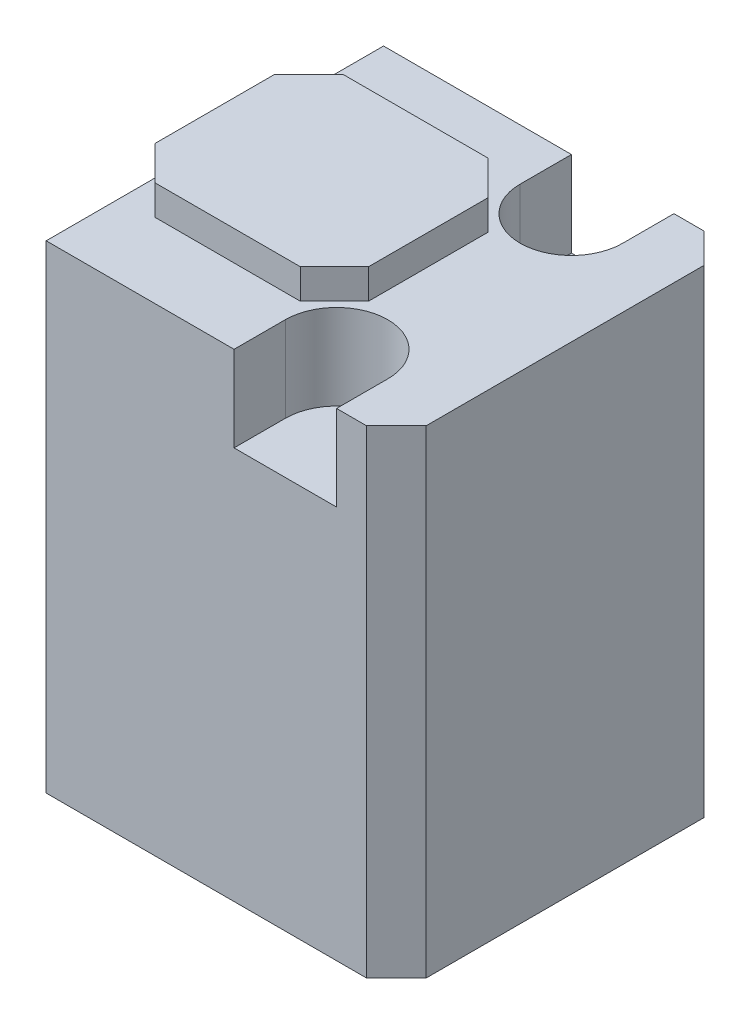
ISO-10303-21;
HEADER;
FILE_DESCRIPTION(('STEP AP214'),'2;1');
FILE_NAME('part.step','',(''),(''),'','','');
FILE_SCHEMA(('AUTOMOTIVE_DESIGN { 1 0 10303 214 1 1 1 1 }'));
ENDSEC;
DATA;
#1=APPLICATION_CONTEXT('core data for automotive mechanical design processes');
#2=APPLICATION_PROTOCOL_DEFINITION('international standard','automotive_design',2000,#1);
#3=PRODUCT_CONTEXT('',#1,'mechanical');
#4=PRODUCT('Part','Part','',(#3));
#5=PRODUCT_RELATED_PRODUCT_CATEGORY('part','',(#4));
#6=PRODUCT_DEFINITION_FORMATION('','',#4);
#7=PRODUCT_DEFINITION_CONTEXT('part definition',#1,'design');
#8=PRODUCT_DEFINITION('design','',#6,#7);
#9=PRODUCT_DEFINITION_SHAPE('','',#8);
#10=(LENGTH_UNIT() NAMED_UNIT(*) SI_UNIT(.MILLI.,.METRE.));
#11=(NAMED_UNIT(*) PLANE_ANGLE_UNIT() SI_UNIT($,.RADIAN.));
#12=(NAMED_UNIT(*) SI_UNIT($,.STERADIAN.) SOLID_ANGLE_UNIT());
#13=UNCERTAINTY_MEASURE_WITH_UNIT(LENGTH_MEASURE(1.E-05),#10,'distance_accuracy_value','');
#14=(GEOMETRIC_REPRESENTATION_CONTEXT(3) GLOBAL_UNCERTAINTY_ASSIGNED_CONTEXT((#13)) GLOBAL_UNIT_ASSIGNED_CONTEXT((#10,
#11,#12)) REPRESENTATION_CONTEXT('',''));
#15=CARTESIAN_POINT('',(0.,0.,0.));
#16=DIRECTION('',(0.,0.,1.));
#17=DIRECTION('',(1.,0.,0.));
#18=AXIS2_PLACEMENT_3D('',#15,#16,#17);
#19=CARTESIAN_POINT('',(0.,14.224,-10.033));
#20=DIRECTION('',(0.,-1.,0.));
#21=DIRECTION('',(0.,0.,-1.));
#22=AXIS2_PLACEMENT_3D('',#19,#20,#21);
#23=PLANE('',#22);
#24=DIRECTION('',(0.707106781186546,0.,0.707106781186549));
#25=VECTOR('',#24,1.);
#26=CARTESIAN_POINT('',(0.,14.224,-3.23850000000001));
#27=LINE('',#26,#25);
#28=CARTESIAN_POINT('',(0.,14.224,-3.23850000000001));
#29=VERTEX_POINT('',#28);
#30=CARTESIAN_POINT('',(1.016,14.224,-2.2225));
#31=VERTEX_POINT('',#30);
#32=EDGE_CURVE('E376',#29,#31,#27,.T.);
#33=ORIENTED_EDGE('',*,*,#32,.F.);
#34=DIRECTION('',(0.,0.,1.));
#35=VECTOR('',#34,1.);
#36=CARTESIAN_POINT('',(0.,14.224,0.));
#37=LINE('',#36,#35);
#38=CARTESIAN_POINT('',(0.,14.224,0.));
#39=VERTEX_POINT('',#38);
#40=EDGE_CURVE('E270',#29,#39,#37,.T.);
#41=ORIENTED_EDGE('',*,*,#40,.T.);
#42=DIRECTION('',(1.,0.,0.));
#43=VECTOR('',#42,1.);
#44=CARTESIAN_POINT('',(0.,14.224,0.));
#45=LINE('',#44,#43);
#46=CARTESIAN_POINT('',(5.588,14.224,0.));
#47=VERTEX_POINT('',#46);
#48=EDGE_CURVE('E273',#39,#47,#45,.T.);
#49=ORIENTED_EDGE('',*,*,#48,.T.);
#50=DIRECTION('',(0.,0.,1.));
#51=VECTOR('',#50,1.);
#52=CARTESIAN_POINT('',(5.588,14.224,0.));
#53=LINE('',#52,#51);
#54=CARTESIAN_POINT('',(5.588,14.224,-1.524));
#55=VERTEX_POINT('',#54);
#56=EDGE_CURVE('E223',#55,#47,#53,.T.);
#57=ORIENTED_EDGE('',*,*,#56,.F.);
#58=CARTESIAN_POINT('',(7.112,14.224,-1.524));
#59=DIRECTION('',(0.,1.,0.));
#60=DIRECTION('',(0.,0.,1.));
#61=AXIS2_PLACEMENT_3D('',#58,#59,#60);
#62=CIRCLE('',#61,1.524);
#63=CARTESIAN_POINT('',(8.636,14.224,-1.524));
#64=VERTEX_POINT('',#63);
#65=EDGE_CURVE('E235',#64,#55,#62,.T.);
#66=ORIENTED_EDGE('',*,*,#65,.F.);
#67=DIRECTION('',(0.,0.,-1.));
#68=VECTOR('',#67,1.);
#69=CARTESIAN_POINT('',(8.636,14.224,0.));
#70=LINE('',#69,#68);
#71=CARTESIAN_POINT('',(8.636,14.224,0.));
#72=VERTEX_POINT('',#71);
#73=EDGE_CURVE('E232',#72,#64,#70,.T.);
#74=ORIENTED_EDGE('',*,*,#73,.F.);
#75=CARTESIAN_POINT('',(9.525,14.224,0.));
#76=VERTEX_POINT('',#75);
#77=EDGE_CURVE('E280',#72,#76,#45,.T.);
#78=ORIENTED_EDGE('',*,*,#77,.T.);
#79=DIRECTION('',(-0.707106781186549,0.,0.707106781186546));
#80=VECTOR('',#79,1.);
#81=CARTESIAN_POINT('',(10.414,14.224,-0.889000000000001));
#82=LINE('',#81,#80);
#83=CARTESIAN_POINT('',(10.414,14.224,-0.889000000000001));
#84=VERTEX_POINT('',#83);
#85=EDGE_CURVE('E283',#76,#84,#82,.F.);
#86=ORIENTED_EDGE('',*,*,#85,.T.);
#87=DIRECTION('',(0.,0.,-1.));
#88=VECTOR('',#87,1.);
#89=CARTESIAN_POINT('',(10.414,14.224,0.));
#90=LINE('',#89,#88);
#91=CARTESIAN_POINT('',(10.414,14.224,-9.144));
#92=VERTEX_POINT('',#91);
#93=EDGE_CURVE('E306',#84,#92,#90,.T.);
#94=ORIENTED_EDGE('',*,*,#93,.T.);
#95=DIRECTION('',(0.707106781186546,0.,0.707106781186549));
#96=VECTOR('',#95,1.);
#97=CARTESIAN_POINT('',(9.525,14.224,-10.033));
#98=LINE('',#97,#96);
#99=CARTESIAN_POINT('',(9.525,14.224,-10.033));
#100=VERTEX_POINT('',#99);
#101=EDGE_CURVE('E35',#92,#100,#98,.F.);
#102=ORIENTED_EDGE('',*,*,#101,.T.);
#103=DIRECTION('',(-1.,0.,0.));
#104=VECTOR('',#103,1.);
#105=CARTESIAN_POINT('',(0.,14.224,-10.033));
#106=LINE('',#105,#104);
#107=CARTESIAN_POINT('',(8.636,14.224,-10.033));
#108=VERTEX_POINT('',#107);
#109=EDGE_CURVE('E303',#100,#108,#106,.T.);
#110=ORIENTED_EDGE('',*,*,#109,.T.);
#111=DIRECTION('',(0.,0.,1.));
#112=VECTOR('',#111,1.);
#113=CARTESIAN_POINT('',(8.636,14.224,-10.033));
#114=LINE('',#113,#112);
#115=CARTESIAN_POINT('',(8.636,14.224,-8.509));
#116=VERTEX_POINT('',#115);
#117=EDGE_CURVE('E207',#108,#116,#114,.T.);
#118=ORIENTED_EDGE('',*,*,#117,.T.);
#119=CARTESIAN_POINT('',(7.112,14.224,-8.509));
#120=DIRECTION('',(0.,-1.,0.));
#121=DIRECTION('',(0.,0.,-1.));
#122=AXIS2_PLACEMENT_3D('',#119,#120,#121);
#123=CIRCLE('',#122,1.524);
#124=CARTESIAN_POINT('',(5.588,14.224,-8.509));
#125=VERTEX_POINT('',#124);
#126=EDGE_CURVE('E204',#116,#125,#123,.T.);
#127=ORIENTED_EDGE('',*,*,#126,.T.);
#128=DIRECTION('',(0.,0.,-1.));
#129=VECTOR('',#128,1.);
#130=CARTESIAN_POINT('',(5.588,14.224,-10.033));
#131=LINE('',#130,#129);
#132=CARTESIAN_POINT('',(5.588,14.224,-10.033));
#133=VERTEX_POINT('',#132);
#134=EDGE_CURVE('E196',#125,#133,#131,.T.);
#135=ORIENTED_EDGE('',*,*,#134,.T.);
#136=CARTESIAN_POINT('',(0.,14.224,-10.033));
#137=VERTEX_POINT('',#136);
#138=EDGE_CURVE('E305',#133,#137,#106,.T.);
#139=ORIENTED_EDGE('',*,*,#138,.T.);
#140=CARTESIAN_POINT('',(0.,14.224,-6.79450000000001));
#141=VERTEX_POINT('',#140);
#142=EDGE_CURVE('E279',#137,#141,#37,.T.);
#143=ORIENTED_EDGE('',*,*,#142,.T.);
#144=DIRECTION('',(-0.707106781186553,0.,0.707106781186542));
#145=VECTOR('',#144,1.);
#146=CARTESIAN_POINT('',(0.,14.224,-6.79450000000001));
#147=LINE('',#146,#145);
#148=CARTESIAN_POINT('',(1.016,14.224,-7.8105));
#149=VERTEX_POINT('',#148);
#150=EDGE_CURVE('E373',#149,#141,#147,.T.);
#151=ORIENTED_EDGE('',*,*,#150,.F.);
#152=DIRECTION('',(-1.,0.,0.));
#153=VECTOR('',#152,1.);
#154=CARTESIAN_POINT('',(1.016,14.224,-7.8105));
#155=LINE('',#154,#153);
#156=CARTESIAN_POINT('',(5.334,14.224,-7.8105));
#157=VERTEX_POINT('',#156);
#158=EDGE_CURVE('E178',#157,#149,#155,.T.);
#159=ORIENTED_EDGE('',*,*,#158,.F.);
#160=DIRECTION('',(-0.707106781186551,0.,-0.707106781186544));
#161=VECTOR('',#160,1.);
#162=CARTESIAN_POINT('',(6.35,14.224,-6.79450000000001));
#163=LINE('',#162,#161);
#164=CARTESIAN_POINT('',(6.35,14.224,-6.79450000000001));
#165=VERTEX_POINT('',#164);
#166=EDGE_CURVE('E173',#165,#157,#163,.T.);
#167=ORIENTED_EDGE('',*,*,#166,.F.);
#168=DIRECTION('',(0.,0.,-1.));
#169=VECTOR('',#168,1.);
#170=CARTESIAN_POINT('',(6.35,14.224,-3.23850000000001));
#171=LINE('',#170,#169);
#172=CARTESIAN_POINT('',(6.35,14.224,-3.23850000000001));
#173=VERTEX_POINT('',#172);
#174=EDGE_CURVE('E175',#173,#165,#171,.T.);
#175=ORIENTED_EDGE('',*,*,#174,.F.);
#176=DIRECTION('',(0.707106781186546,0.,-0.707106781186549));
#177=VECTOR('',#176,1.);
#178=CARTESIAN_POINT('',(5.334,14.224,-2.2225));
#179=LINE('',#178,#177);
#180=CARTESIAN_POINT('',(5.334,14.224,-2.2225));
#181=VERTEX_POINT('',#180);
#182=EDGE_CURVE('E48',#181,#173,#179,.T.);
#183=ORIENTED_EDGE('',*,*,#182,.F.);
#184=DIRECTION('',(1.,0.,0.));
#185=VECTOR('',#184,1.);
#186=CARTESIAN_POINT('',(1.016,14.224,-2.2225));
#187=LINE('',#186,#185);
#188=EDGE_CURVE('E43',#31,#181,#187,.T.);
#189=ORIENTED_EDGE('',*,*,#188,.F.);
#190=EDGE_LOOP('',(#33,#41,#49,#57,#66,#74,#78,#86,#94,#102,#110,#118,#127,#135,#139,#143,#151,
#159,#167,#175,#183,#189));
#191=FACE_BOUND('',#190,.T.);
#192=ADVANCED_FACE('F26',(#191),#23,.F.);
#193=CARTESIAN_POINT('',(0.,14.224,-10.033));
#194=DIRECTION('',(0.,0.,1.));
#195=DIRECTION('',(1.,0.,0.));
#196=AXIS2_PLACEMENT_3D('',#193,#194,#195);
#197=PLANE('',#196);
#198=DIRECTION('',(0.,1.,0.));
#199=VECTOR('',#198,1.);
#200=CARTESIAN_POINT('',(5.588,11.684,-10.033));
#201=LINE('',#200,#199);
#202=CARTESIAN_POINT('',(5.588,11.684,-10.033));
#203=VERTEX_POINT('',#202);
#204=EDGE_CURVE('E221',#203,#133,#201,.T.);
#205=ORIENTED_EDGE('',*,*,#204,.F.);
#206=DIRECTION('',(1.,0.,0.));
#207=VECTOR('',#206,1.);
#208=CARTESIAN_POINT('',(5.588,11.684,-10.033));
#209=LINE('',#208,#207);
#210=CARTESIAN_POINT('',(8.636,11.684,-10.033));
#211=VERTEX_POINT('',#210);
#212=EDGE_CURVE('E217',#203,#211,#209,.T.);
#213=ORIENTED_EDGE('',*,*,#212,.T.);
#214=DIRECTION('',(0.,1.,0.));
#215=VECTOR('',#214,1.);
#216=CARTESIAN_POINT('',(8.636,11.684,-10.033));
#217=LINE('',#216,#215);
#218=EDGE_CURVE('E224',#211,#108,#217,.T.);
#219=ORIENTED_EDGE('',*,*,#218,.T.);
#220=ORIENTED_EDGE('',*,*,#109,.F.);
#221=DIRECTION('',(0.,-1.,0.));
#222=VECTOR('',#221,1.);
#223=CARTESIAN_POINT('',(9.525,14.224,-10.033));
#224=LINE('',#223,#222);
#225=CARTESIAN_POINT('',(9.525,0.,-10.033));
#226=VERTEX_POINT('',#225);
#227=EDGE_CURVE('E294',#100,#226,#224,.T.);
#228=ORIENTED_EDGE('',*,*,#227,.T.);
#229=DIRECTION('',(-1.,0.,0.));
#230=VECTOR('',#229,1.);
#231=CARTESIAN_POINT('',(0.,0.,-10.033));
#232=LINE('',#231,#230);
#233=CARTESIAN_POINT('',(0.,0.,-10.033));
#234=VERTEX_POINT('',#233);
#235=EDGE_CURVE('E268',#226,#234,#232,.T.);
#236=ORIENTED_EDGE('',*,*,#235,.T.);
#237=DIRECTION('',(0.,-1.,0.));
#238=VECTOR('',#237,1.);
#239=CARTESIAN_POINT('',(0.,14.224,-10.033));
#240=LINE('',#239,#238);
#241=EDGE_CURVE('E300',#137,#234,#240,.T.);
#242=ORIENTED_EDGE('',*,*,#241,.F.);
#243=ORIENTED_EDGE('',*,*,#138,.F.);
#244=EDGE_LOOP('',(#205,#213,#219,#220,#228,#236,#242,#243));
#245=FACE_BOUND('',#244,.T.);
#246=ADVANCED_FACE('F339',(#245),#197,.F.);
#247=CARTESIAN_POINT('',(0.,14.224,0.));
#248=DIRECTION('',(1.,0.,0.));
#249=DIRECTION('',(0.,0.,-1.));
#250=AXIS2_PLACEMENT_3D('',#247,#248,#249);
#251=PLANE('',#250);
#252=DIRECTION('',(0.,0.,1.));
#253=VECTOR('',#252,1.);
#254=CARTESIAN_POINT('',(0.,0.,0.));
#255=LINE('',#254,#253);
#256=CARTESIAN_POINT('',(0.,0.,0.));
#257=VERTEX_POINT('',#256);
#258=EDGE_CURVE('E253',#234,#257,#255,.T.);
#259=ORIENTED_EDGE('',*,*,#258,.T.);
#260=DIRECTION('',(0.,-1.,0.));
#261=VECTOR('',#260,1.);
#262=CARTESIAN_POINT('',(0.,14.224,0.));
#263=LINE('',#262,#261);
#264=EDGE_CURVE('E297',#39,#257,#263,.T.);
#265=ORIENTED_EDGE('',*,*,#264,.F.);
#266=ORIENTED_EDGE('',*,*,#40,.F.);
#267=DIRECTION('',(0.,-1.,0.));
#268=VECTOR('',#267,1.);
#269=CARTESIAN_POINT('',(0.,15.113,-3.23850000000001));
#270=LINE('',#269,#268);
#271=CARTESIAN_POINT('',(0.,15.113,-3.23850000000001));
#272=VERTEX_POINT('',#271);
#273=EDGE_CURVE('E367',#272,#29,#270,.T.);
#274=ORIENTED_EDGE('',*,*,#273,.F.);
#275=DIRECTION('',(0.,0.,1.));
#276=VECTOR('',#275,1.);
#277=CARTESIAN_POINT('',(0.,15.113,-3.23850000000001));
#278=LINE('',#277,#276);
#279=CARTESIAN_POINT('',(0.,15.113,-6.79450000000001));
#280=VERTEX_POINT('',#279);
#281=EDGE_CURVE('E364',#280,#272,#278,.T.);
#282=ORIENTED_EDGE('',*,*,#281,.F.);
#283=DIRECTION('',(0.,-1.,0.));
#284=VECTOR('',#283,1.);
#285=CARTESIAN_POINT('',(0.,15.113,-6.79450000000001));
#286=LINE('',#285,#284);
#287=EDGE_CURVE('E362',#280,#141,#286,.T.);
#288=ORIENTED_EDGE('',*,*,#287,.T.);
#289=ORIENTED_EDGE('',*,*,#142,.F.);
#290=ORIENTED_EDGE('',*,*,#241,.T.);
#291=EDGE_LOOP('',(#259,#265,#266,#274,#282,#288,#289,#290));
#292=FACE_BOUND('',#291,.T.);
#293=ADVANCED_FACE('F28',(#292),#251,.F.);
#294=CARTESIAN_POINT('',(0.,14.224,0.));
#295=DIRECTION('',(0.,0.,-1.));
#296=DIRECTION('',(-1.,0.,0.));
#297=AXIS2_PLACEMENT_3D('',#294,#295,#296);
#298=PLANE('',#297);
#299=DIRECTION('',(1.,0.,0.));
#300=VECTOR('',#299,1.);
#301=CARTESIAN_POINT('',(5.588,11.684,0.));
#302=LINE('',#301,#300);
#303=CARTESIAN_POINT('',(5.588,11.684,0.));
#304=VERTEX_POINT('',#303);
#305=CARTESIAN_POINT('',(8.636,11.684,0.));
#306=VERTEX_POINT('',#305);
#307=EDGE_CURVE('E241',#304,#306,#302,.T.);
#308=ORIENTED_EDGE('',*,*,#307,.F.);
#309=DIRECTION('',(0.,1.,0.));
#310=VECTOR('',#309,1.);
#311=CARTESIAN_POINT('',(5.588,11.684,0.));
#312=LINE('',#311,#310);
#313=EDGE_CURVE('E250',#304,#47,#312,.T.);
#314=ORIENTED_EDGE('',*,*,#313,.T.);
#315=ORIENTED_EDGE('',*,*,#48,.F.);
#316=ORIENTED_EDGE('',*,*,#264,.T.);
#317=DIRECTION('',(1.,0.,0.));
#318=VECTOR('',#317,1.);
#319=CARTESIAN_POINT('',(0.,0.,0.));
#320=LINE('',#319,#318);
#321=CARTESIAN_POINT('',(9.525,0.,0.));
#322=VERTEX_POINT('',#321);
#323=EDGE_CURVE('E262',#257,#322,#320,.T.);
#324=ORIENTED_EDGE('',*,*,#323,.T.);
#325=DIRECTION('',(0.,1.,0.));
#326=VECTOR('',#325,1.);
#327=CARTESIAN_POINT('',(9.525,14.224,0.));
#328=LINE('',#327,#326);
#329=EDGE_CURVE('E11',#322,#76,#328,.T.);
#330=ORIENTED_EDGE('',*,*,#329,.T.);
#331=ORIENTED_EDGE('',*,*,#77,.F.);
#332=DIRECTION('',(0.,1.,0.));
#333=VECTOR('',#332,1.);
#334=CARTESIAN_POINT('',(8.636,11.684,0.));
#335=LINE('',#334,#333);
#336=EDGE_CURVE('E256',#306,#72,#335,.T.);
#337=ORIENTED_EDGE('',*,*,#336,.F.);
#338=EDGE_LOOP('',(#308,#314,#315,#316,#324,#330,#331,#337));
#339=FACE_BOUND('',#338,.T.);
#340=ADVANCED_FACE('F321',(#339),#298,.F.);
#341=CARTESIAN_POINT('',(10.414,14.224,0.));
#342=DIRECTION('',(-1.,0.,0.));
#343=DIRECTION('',(0.,0.,1.));
#344=AXIS2_PLACEMENT_3D('',#341,#342,#343);
#345=PLANE('',#344);
#346=DIRECTION('',(0.,0.,-1.));
#347=VECTOR('',#346,1.);
#348=CARTESIAN_POINT('',(10.414,0.,0.));
#349=LINE('',#348,#347);
#350=CARTESIAN_POINT('',(10.414,0.,-0.889000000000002));
#351=VERTEX_POINT('',#350);
#352=CARTESIAN_POINT('',(10.414,0.,-9.144));
#353=VERTEX_POINT('',#352);
#354=EDGE_CURVE('E265',#351,#353,#349,.T.);
#355=ORIENTED_EDGE('',*,*,#354,.T.);
#356=DIRECTION('',(0.,1.,0.));
#357=VECTOR('',#356,1.);
#358=CARTESIAN_POINT('',(10.414,14.224,-9.144));
#359=LINE('',#358,#357);
#360=EDGE_CURVE('E285',#353,#92,#359,.T.);
#361=ORIENTED_EDGE('',*,*,#360,.T.);
#362=ORIENTED_EDGE('',*,*,#93,.F.);
#363=DIRECTION('',(0.,-1.,0.));
#364=VECTOR('',#363,1.);
#365=CARTESIAN_POINT('',(10.414,14.224,-0.889000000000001));
#366=LINE('',#365,#364);
#367=EDGE_CURVE('E287',#84,#351,#366,.T.);
#368=ORIENTED_EDGE('',*,*,#367,.T.);
#369=EDGE_LOOP('',(#355,#361,#362,#368));
#370=FACE_BOUND('',#369,.T.);
#371=ADVANCED_FACE('F327',(#370),#345,.F.);
#372=CARTESIAN_POINT('',(0.,0.,-10.033));
#373=DIRECTION('',(0.,-1.,0.));
#374=DIRECTION('',(0.,0.,-1.));
#375=AXIS2_PLACEMENT_3D('',#372,#373,#374);
#376=PLANE('',#375);
#377=ORIENTED_EDGE('',*,*,#235,.F.);
#378=DIRECTION('',(-0.707106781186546,0.,-0.707106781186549));
#379=VECTOR('',#378,1.);
#380=CARTESIAN_POINT('',(4.76250000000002,0.,-14.7955));
#381=LINE('',#380,#379);
#382=EDGE_CURVE('E290',#226,#353,#381,.F.);
#383=ORIENTED_EDGE('',*,*,#382,.T.);
#384=ORIENTED_EDGE('',*,*,#354,.F.);
#385=DIRECTION('',(0.707106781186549,0.,-0.707106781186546));
#386=VECTOR('',#385,1.);
#387=CARTESIAN_POINT('',(9.77899999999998,0.,-0.253999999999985));
#388=LINE('',#387,#386);
#389=EDGE_CURVE('E292',#351,#322,#388,.F.);
#390=ORIENTED_EDGE('',*,*,#389,.T.);
#391=ORIENTED_EDGE('',*,*,#323,.F.);
#392=ORIENTED_EDGE('',*,*,#258,.F.);
#393=EDGE_LOOP('',(#377,#383,#384,#390,#391,#392));
#394=FACE_BOUND('',#393,.T.);
#395=ADVANCED_FACE('F331',(#394),#376,.T.);
#396=CARTESIAN_POINT('',(9.525,14.224,-10.033));
#397=DIRECTION('',(-0.707106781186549,0.,0.707106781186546));
#398=DIRECTION('',(0.707106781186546,0.,0.707106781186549));
#399=AXIS2_PLACEMENT_3D('',#396,#397,#398);
#400=PLANE('',#399);
#401=ORIENTED_EDGE('',*,*,#101,.F.);
#402=ORIENTED_EDGE('',*,*,#360,.F.);
#403=ORIENTED_EDGE('',*,*,#382,.F.);
#404=ORIENTED_EDGE('',*,*,#227,.F.);
#405=EDGE_LOOP('',(#401,#402,#403,#404));
#406=FACE_BOUND('',#405,.T.);
#407=ADVANCED_FACE('F335',(#406),#400,.F.);
#408=CARTESIAN_POINT('',(10.414,14.224,-0.889000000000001));
#409=DIRECTION('',(-0.707106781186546,0.,-0.707106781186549));
#410=DIRECTION('',(-0.707106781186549,0.,0.707106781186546));
#411=AXIS2_PLACEMENT_3D('',#408,#409,#410);
#412=PLANE('',#411);
#413=ORIENTED_EDGE('',*,*,#85,.F.);
#414=ORIENTED_EDGE('',*,*,#329,.F.);
#415=ORIENTED_EDGE('',*,*,#389,.F.);
#416=ORIENTED_EDGE('',*,*,#367,.F.);
#417=EDGE_LOOP('',(#413,#414,#415,#416));
#418=FACE_BOUND('',#417,.T.);
#419=ADVANCED_FACE('F324',(#418),#412,.F.);
#420=CARTESIAN_POINT('',(5.588,11.684,0.));
#421=DIRECTION('',(-1.,0.,0.));
#422=DIRECTION('',(0.,0.,1.));
#423=AXIS2_PLACEMENT_3D('',#420,#421,#422);
#424=PLANE('',#423);
#425=ORIENTED_EDGE('',*,*,#56,.T.);
#426=ORIENTED_EDGE('',*,*,#313,.F.);
#427=DIRECTION('',(0.,0.,1.));
#428=VECTOR('',#427,1.);
#429=CARTESIAN_POINT('',(5.588,11.684,0.));
#430=LINE('',#429,#428);
#431=CARTESIAN_POINT('',(5.588,11.684,-1.524));
#432=VERTEX_POINT('',#431);
#433=EDGE_CURVE('E238',#432,#304,#430,.T.);
#434=ORIENTED_EDGE('',*,*,#433,.F.);
#435=DIRECTION('',(0.,1.,0.));
#436=VECTOR('',#435,1.);
#437=CARTESIAN_POINT('',(5.588,11.684,-1.524));
#438=LINE('',#437,#436);
#439=EDGE_CURVE('E251',#432,#55,#438,.T.);
#440=ORIENTED_EDGE('',*,*,#439,.T.);
#441=EDGE_LOOP('',(#425,#426,#434,#440));
#442=FACE_BOUND('',#441,.T.);
#443=ADVANCED_FACE('F415',(#442),#424,.F.);
#444=CARTESIAN_POINT('',(7.112,11.684,-1.524));
#445=DIRECTION('',(0.,1.,0.));
#446=DIRECTION('',(0.,0.,1.));
#447=AXIS2_PLACEMENT_3D('',#444,#445,#446);
#448=CYLINDRICAL_SURFACE('',#447,1.524);
#449=ORIENTED_EDGE('',*,*,#65,.T.);
#450=ORIENTED_EDGE('',*,*,#439,.F.);
#451=CARTESIAN_POINT('',(7.112,11.684,-1.524));
#452=DIRECTION('',(0.,1.,0.));
#453=DIRECTION('',(0.,0.,1.));
#454=AXIS2_PLACEMENT_3D('',#451,#452,#453);
#455=CIRCLE('',#454,1.524);
#456=CARTESIAN_POINT('',(8.636,11.684,-1.524));
#457=VERTEX_POINT('',#456);
#458=EDGE_CURVE('E247',#457,#432,#455,.T.);
#459=ORIENTED_EDGE('',*,*,#458,.F.);
#460=DIRECTION('',(0.,1.,0.));
#461=VECTOR('',#460,1.);
#462=CARTESIAN_POINT('',(8.636,11.684,-1.524));
#463=LINE('',#462,#461);
#464=EDGE_CURVE('E254',#457,#64,#463,.T.);
#465=ORIENTED_EDGE('',*,*,#464,.T.);
#466=EDGE_LOOP('',(#449,#450,#459,#465));
#467=FACE_BOUND('',#466,.T.);
#468=ADVANCED_FACE('F420',(#467),#448,.F.);
#469=CARTESIAN_POINT('',(8.636,11.684,0.));
#470=DIRECTION('',(1.,0.,0.));
#471=DIRECTION('',(0.,0.,-1.));
#472=AXIS2_PLACEMENT_3D('',#469,#470,#471);
#473=PLANE('',#472);
#474=ORIENTED_EDGE('',*,*,#73,.T.);
#475=ORIENTED_EDGE('',*,*,#464,.F.);
#476=DIRECTION('',(0.,0.,-1.));
#477=VECTOR('',#476,1.);
#478=CARTESIAN_POINT('',(8.636,11.684,0.));
#479=LINE('',#478,#477);
#480=EDGE_CURVE('E244',#306,#457,#479,.T.);
#481=ORIENTED_EDGE('',*,*,#480,.F.);
#482=ORIENTED_EDGE('',*,*,#336,.T.);
#483=EDGE_LOOP('',(#474,#475,#481,#482));
#484=FACE_BOUND('',#483,.T.);
#485=ADVANCED_FACE('F422',(#484),#473,.F.);
#486=CARTESIAN_POINT('',(7.112,11.684,-1.524));
#487=DIRECTION('',(0.,1.,0.));
#488=DIRECTION('',(0.,0.,1.));
#489=AXIS2_PLACEMENT_3D('',#486,#487,#488);
#490=PLANE('',#489);
#491=ORIENTED_EDGE('',*,*,#433,.T.);
#492=ORIENTED_EDGE('',*,*,#307,.T.);
#493=ORIENTED_EDGE('',*,*,#480,.T.);
#494=ORIENTED_EDGE('',*,*,#458,.T.);
#495=EDGE_LOOP('',(#491,#492,#493,#494));
#496=FACE_BOUND('',#495,.T.);
#497=ADVANCED_FACE('F417',(#496),#490,.T.);
#498=CARTESIAN_POINT('',(5.588,11.684,-10.033));
#499=DIRECTION('',(1.,0.,0.));
#500=DIRECTION('',(0.,0.,-1.));
#501=AXIS2_PLACEMENT_3D('',#498,#499,#500);
#502=PLANE('',#501);
#503=ORIENTED_EDGE('',*,*,#134,.F.);
#504=DIRECTION('',(0.,1.,0.));
#505=VECTOR('',#504,1.);
#506=CARTESIAN_POINT('',(5.588,11.684,-8.509));
#507=LINE('',#506,#505);
#508=CARTESIAN_POINT('',(5.588,11.684,-8.509));
#509=VERTEX_POINT('',#508);
#510=EDGE_CURVE('E220',#509,#125,#507,.T.);
#511=ORIENTED_EDGE('',*,*,#510,.F.);
#512=DIRECTION('',(0.,0.,-1.));
#513=VECTOR('',#512,1.);
#514=CARTESIAN_POINT('',(5.588,11.684,-10.033));
#515=LINE('',#514,#513);
#516=EDGE_CURVE('E210',#509,#203,#515,.T.);
#517=ORIENTED_EDGE('',*,*,#516,.T.);
#518=ORIENTED_EDGE('',*,*,#204,.T.);
#519=EDGE_LOOP('',(#503,#511,#517,#518));
#520=FACE_BOUND('',#519,.T.);
#521=ADVANCED_FACE('F352',(#520),#502,.T.);
#522=CARTESIAN_POINT('',(8.636,11.684,-10.033));
#523=DIRECTION('',(-1.,0.,0.));
#524=DIRECTION('',(0.,0.,1.));
#525=AXIS2_PLACEMENT_3D('',#522,#523,#524);
#526=PLANE('',#525);
#527=ORIENTED_EDGE('',*,*,#117,.F.);
#528=ORIENTED_EDGE('',*,*,#218,.F.);
#529=DIRECTION('',(0.,0.,1.));
#530=VECTOR('',#529,1.);
#531=CARTESIAN_POINT('',(8.636,11.684,-10.033));
#532=LINE('',#531,#530);
#533=CARTESIAN_POINT('',(8.636,11.684,-8.509));
#534=VERTEX_POINT('',#533);
#535=EDGE_CURVE('E215',#211,#534,#532,.T.);
#536=ORIENTED_EDGE('',*,*,#535,.T.);
#537=DIRECTION('',(0.,1.,0.));
#538=VECTOR('',#537,1.);
#539=CARTESIAN_POINT('',(8.636,11.684,-8.509));
#540=LINE('',#539,#538);
#541=EDGE_CURVE('E227',#534,#116,#540,.T.);
#542=ORIENTED_EDGE('',*,*,#541,.T.);
#543=EDGE_LOOP('',(#527,#528,#536,#542));
#544=FACE_BOUND('',#543,.T.);
#545=ADVANCED_FACE('F343',(#544),#526,.T.);
#546=CARTESIAN_POINT('',(7.112,11.684,-8.509));
#547=DIRECTION('',(0.,1.,0.));
#548=DIRECTION('',(0.,0.,1.));
#549=AXIS2_PLACEMENT_3D('',#546,#547,#548);
#550=CYLINDRICAL_SURFACE('',#549,1.524);
#551=ORIENTED_EDGE('',*,*,#126,.F.);
#552=ORIENTED_EDGE('',*,*,#541,.F.);
#553=CARTESIAN_POINT('',(7.112,11.684,-8.509));
#554=DIRECTION('',(0.,-1.,0.));
#555=DIRECTION('',(0.,0.,-1.));
#556=AXIS2_PLACEMENT_3D('',#553,#554,#555);
#557=CIRCLE('',#556,1.524);
#558=EDGE_CURVE('E213',#534,#509,#557,.T.);
#559=ORIENTED_EDGE('',*,*,#558,.T.);
#560=ORIENTED_EDGE('',*,*,#510,.T.);
#561=EDGE_LOOP('',(#551,#552,#559,#560));
#562=FACE_BOUND('',#561,.T.);
#563=ADVANCED_FACE('F348',(#562),#550,.F.);
#564=CARTESIAN_POINT('',(7.112,11.684,-8.509));
#565=DIRECTION('',(0.,1.,0.));
#566=DIRECTION('',(0.,0.,-1.));
#567=AXIS2_PLACEMENT_3D('',#564,#565,#566);
#568=PLANE('',#567);
#569=ORIENTED_EDGE('',*,*,#516,.F.);
#570=ORIENTED_EDGE('',*,*,#558,.F.);
#571=ORIENTED_EDGE('',*,*,#535,.F.);
#572=ORIENTED_EDGE('',*,*,#212,.F.);
#573=EDGE_LOOP('',(#569,#570,#571,#572));
#574=FACE_BOUND('',#573,.T.);
#575=ADVANCED_FACE('F354',(#574),#568,.T.);
#576=CARTESIAN_POINT('',(5.334,15.113,-2.2225));
#577=DIRECTION('',(-0.707106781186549,0.,-0.707106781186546));
#578=DIRECTION('',(-0.707106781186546,0.,0.707106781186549));
#579=AXIS2_PLACEMENT_3D('',#576,#577,#578);
#580=PLANE('',#579);
#581=ORIENTED_EDGE('',*,*,#182,.T.);
#582=DIRECTION('',(0.,-1.,0.));
#583=VECTOR('',#582,1.);
#584=CARTESIAN_POINT('',(6.35,15.113,-3.23850000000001));
#585=LINE('',#584,#583);
#586=CARTESIAN_POINT('',(6.35,15.113,-3.23850000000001));
#587=VERTEX_POINT('',#586);
#588=EDGE_CURVE('E190',#587,#173,#585,.T.);
#589=ORIENTED_EDGE('',*,*,#588,.F.);
#590=DIRECTION('',(0.707106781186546,0.,-0.707106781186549));
#591=VECTOR('',#590,1.);
#592=CARTESIAN_POINT('',(5.334,15.113,-2.2225));
#593=LINE('',#592,#591);
#594=CARTESIAN_POINT('',(5.334,15.113,-2.2225));
#595=VERTEX_POINT('',#594);
#596=EDGE_CURVE('E382',#595,#587,#593,.T.);
#597=ORIENTED_EDGE('',*,*,#596,.F.);
#598=DIRECTION('',(0.,-1.,0.));
#599=VECTOR('',#598,1.);
#600=CARTESIAN_POINT('',(5.334,15.113,-2.2225));
#601=LINE('',#600,#599);
#602=EDGE_CURVE('E397',#595,#181,#601,.T.);
#603=ORIENTED_EDGE('',*,*,#602,.T.);
#604=EDGE_LOOP('',(#581,#589,#597,#603));
#605=FACE_BOUND('',#604,.T.);
#606=ADVANCED_FACE('F456',(#605),#580,.F.);
#607=CARTESIAN_POINT('',(6.35,15.113,-3.23850000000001));
#608=DIRECTION('',(-1.,0.,0.));
#609=DIRECTION('',(0.,0.,1.));
#610=AXIS2_PLACEMENT_3D('',#607,#608,#609);
#611=PLANE('',#610);
#612=ORIENTED_EDGE('',*,*,#174,.T.);
#613=DIRECTION('',(0.,-1.,0.));
#614=VECTOR('',#613,1.);
#615=CARTESIAN_POINT('',(6.35,15.113,-6.79450000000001));
#616=LINE('',#615,#614);
#617=CARTESIAN_POINT('',(6.35,15.113,-6.79450000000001));
#618=VERTEX_POINT('',#617);
#619=EDGE_CURVE('E187',#618,#165,#616,.T.);
#620=ORIENTED_EDGE('',*,*,#619,.F.);
#621=DIRECTION('',(0.,0.,-1.));
#622=VECTOR('',#621,1.);
#623=CARTESIAN_POINT('',(6.35,15.113,-3.23850000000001));
#624=LINE('',#623,#622);
#625=EDGE_CURVE('E385',#587,#618,#624,.T.);
#626=ORIENTED_EDGE('',*,*,#625,.F.);
#627=ORIENTED_EDGE('',*,*,#588,.T.);
#628=EDGE_LOOP('',(#612,#620,#626,#627));
#629=FACE_BOUND('',#628,.T.);
#630=ADVANCED_FACE('F186',(#629),#611,.F.);
#631=CARTESIAN_POINT('',(6.35,15.113,-6.79450000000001));
#632=DIRECTION('',(-0.707106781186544,0.,0.707106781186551));
#633=DIRECTION('',(0.707106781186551,0.,0.707106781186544));
#634=AXIS2_PLACEMENT_3D('',#631,#632,#633);
#635=PLANE('',#634);
#636=ORIENTED_EDGE('',*,*,#166,.T.);
#637=DIRECTION('',(0.,-1.,0.));
#638=VECTOR('',#637,1.);
#639=CARTESIAN_POINT('',(5.334,15.113,-7.8105));
#640=LINE('',#639,#638);
#641=CARTESIAN_POINT('',(5.334,15.113,-7.8105));
#642=VERTEX_POINT('',#641);
#643=EDGE_CURVE('E194',#642,#157,#640,.T.);
#644=ORIENTED_EDGE('',*,*,#643,.F.);
#645=DIRECTION('',(-0.707106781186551,0.,-0.707106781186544));
#646=VECTOR('',#645,1.);
#647=CARTESIAN_POINT('',(6.35,15.113,-6.79450000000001));
#648=LINE('',#647,#646);
#649=EDGE_CURVE('E193',#618,#642,#648,.T.);
#650=ORIENTED_EDGE('',*,*,#649,.F.);
#651=ORIENTED_EDGE('',*,*,#619,.T.);
#652=EDGE_LOOP('',(#636,#644,#650,#651));
#653=FACE_BOUND('',#652,.T.);
#654=ADVANCED_FACE('F192',(#653),#635,.F.);
#655=CARTESIAN_POINT('',(1.016,15.113,-7.8105));
#656=DIRECTION('',(0.,0.,1.));
#657=DIRECTION('',(1.,0.,0.));
#658=AXIS2_PLACEMENT_3D('',#655,#656,#657);
#659=PLANE('',#658);
#660=ORIENTED_EDGE('',*,*,#158,.T.);
#661=DIRECTION('',(0.,-1.,0.));
#662=VECTOR('',#661,1.);
#663=CARTESIAN_POINT('',(1.016,15.113,-7.8105));
#664=LINE('',#663,#662);
#665=CARTESIAN_POINT('',(1.016,15.113,-7.8105));
#666=VERTEX_POINT('',#665);
#667=EDGE_CURVE('E198',#666,#149,#664,.T.);
#668=ORIENTED_EDGE('',*,*,#667,.F.);
#669=DIRECTION('',(-1.,0.,0.));
#670=VECTOR('',#669,1.);
#671=CARTESIAN_POINT('',(1.016,15.113,-7.8105));
#672=LINE('',#671,#670);
#673=EDGE_CURVE('E388',#642,#666,#672,.T.);
#674=ORIENTED_EDGE('',*,*,#673,.F.);
#675=ORIENTED_EDGE('',*,*,#643,.T.);
#676=EDGE_LOOP('',(#660,#668,#674,#675));
#677=FACE_BOUND('',#676,.T.);
#678=ADVANCED_FACE('F472',(#677),#659,.F.);
#679=CARTESIAN_POINT('',(0.,15.113,-6.79450000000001));
#680=DIRECTION('',(0.707106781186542,0.,0.707106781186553));
#681=DIRECTION('',(0.707106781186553,0.,-0.707106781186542));
#682=AXIS2_PLACEMENT_3D('',#679,#680,#681);
#683=PLANE('',#682);
#684=ORIENTED_EDGE('',*,*,#150,.T.);
#685=ORIENTED_EDGE('',*,*,#287,.F.);
#686=DIRECTION('',(-0.707106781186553,0.,0.707106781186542));
#687=VECTOR('',#686,1.);
#688=CARTESIAN_POINT('',(0.,15.113,-6.79450000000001));
#689=LINE('',#688,#687);
#690=EDGE_CURVE('E390',#666,#280,#689,.T.);
#691=ORIENTED_EDGE('',*,*,#690,.F.);
#692=ORIENTED_EDGE('',*,*,#667,.T.);
#693=EDGE_LOOP('',(#684,#685,#691,#692));
#694=FACE_BOUND('',#693,.T.);
#695=ADVANCED_FACE('F479',(#694),#683,.F.);
#696=CARTESIAN_POINT('',(0.,15.113,-3.23850000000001));
#697=DIRECTION('',(0.707106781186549,0.,-0.707106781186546));
#698=DIRECTION('',(-0.707106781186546,0.,-0.707106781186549));
#699=AXIS2_PLACEMENT_3D('',#696,#697,#698);
#700=PLANE('',#699);
#701=ORIENTED_EDGE('',*,*,#32,.T.);
#702=DIRECTION('',(0.,-1.,0.));
#703=VECTOR('',#702,1.);
#704=CARTESIAN_POINT('',(1.016,15.113,-2.2225));
#705=LINE('',#704,#703);
#706=CARTESIAN_POINT('',(1.016,15.113,-2.2225));
#707=VERTEX_POINT('',#706);
#708=EDGE_CURVE('E370',#707,#31,#705,.T.);
#709=ORIENTED_EDGE('',*,*,#708,.F.);
#710=DIRECTION('',(0.707106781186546,0.,0.707106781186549));
#711=VECTOR('',#710,1.);
#712=CARTESIAN_POINT('',(0.,15.113,-3.23850000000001));
#713=LINE('',#712,#711);
#714=EDGE_CURVE('E393',#272,#707,#713,.T.);
#715=ORIENTED_EDGE('',*,*,#714,.F.);
#716=ORIENTED_EDGE('',*,*,#273,.T.);
#717=EDGE_LOOP('',(#701,#709,#715,#716));
#718=FACE_BOUND('',#717,.T.);
#719=ADVANCED_FACE('F408',(#718),#700,.F.);
#720=CARTESIAN_POINT('',(1.016,15.113,-2.2225));
#721=DIRECTION('',(0.,0.,-1.));
#722=DIRECTION('',(-1.,0.,0.));
#723=AXIS2_PLACEMENT_3D('',#720,#721,#722);
#724=PLANE('',#723);
#725=ORIENTED_EDGE('',*,*,#188,.T.);
#726=ORIENTED_EDGE('',*,*,#602,.F.);
#727=DIRECTION('',(1.,0.,0.));
#728=VECTOR('',#727,1.);
#729=CARTESIAN_POINT('',(1.016,15.113,-2.2225));
#730=LINE('',#729,#728);
#731=EDGE_CURVE('E395',#707,#595,#730,.T.);
#732=ORIENTED_EDGE('',*,*,#731,.F.);
#733=ORIENTED_EDGE('',*,*,#708,.T.);
#734=EDGE_LOOP('',(#725,#726,#732,#733));
#735=FACE_BOUND('',#734,.T.);
#736=ADVANCED_FACE('F404',(#735),#724,.F.);
#737=CARTESIAN_POINT('',(8.12800000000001,15.113,-5.01650000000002));
#738=DIRECTION('',(0.,1.,0.));
#739=DIRECTION('',(0.,0.,1.));
#740=AXIS2_PLACEMENT_3D('',#737,#738,#739);
#741=PLANE('',#740);
#742=ORIENTED_EDGE('',*,*,#596,.T.);
#743=ORIENTED_EDGE('',*,*,#625,.T.);
#744=ORIENTED_EDGE('',*,*,#649,.T.);
#745=ORIENTED_EDGE('',*,*,#673,.T.);
#746=ORIENTED_EDGE('',*,*,#690,.T.);
#747=ORIENTED_EDGE('',*,*,#281,.T.);
#748=ORIENTED_EDGE('',*,*,#714,.T.);
#749=ORIENTED_EDGE('',*,*,#731,.T.);
#750=EDGE_LOOP('',(#742,#743,#744,#745,#746,#747,#748,#749));
#751=FACE_BOUND('',#750,.T.);
#752=ADVANCED_FACE('F499',(#751),#741,.T.);
#753=CLOSED_SHELL('',(#192,#246,#293,#340,#371,#395,#407,#419,#443,#468,#485,#497,#521,#545,
#563,#575,#606,#630,#654,#678,#695,#719,#736,#752));
#754=MANIFOLD_SOLID_BREP('B2',#753);
#755=ADVANCED_BREP_SHAPE_REPRESENTATION('',(#18,#754),#14);
#756=SHAPE_DEFINITION_REPRESENTATION(#9,#755);
ENDSEC;
END-ISO-10303-21;
